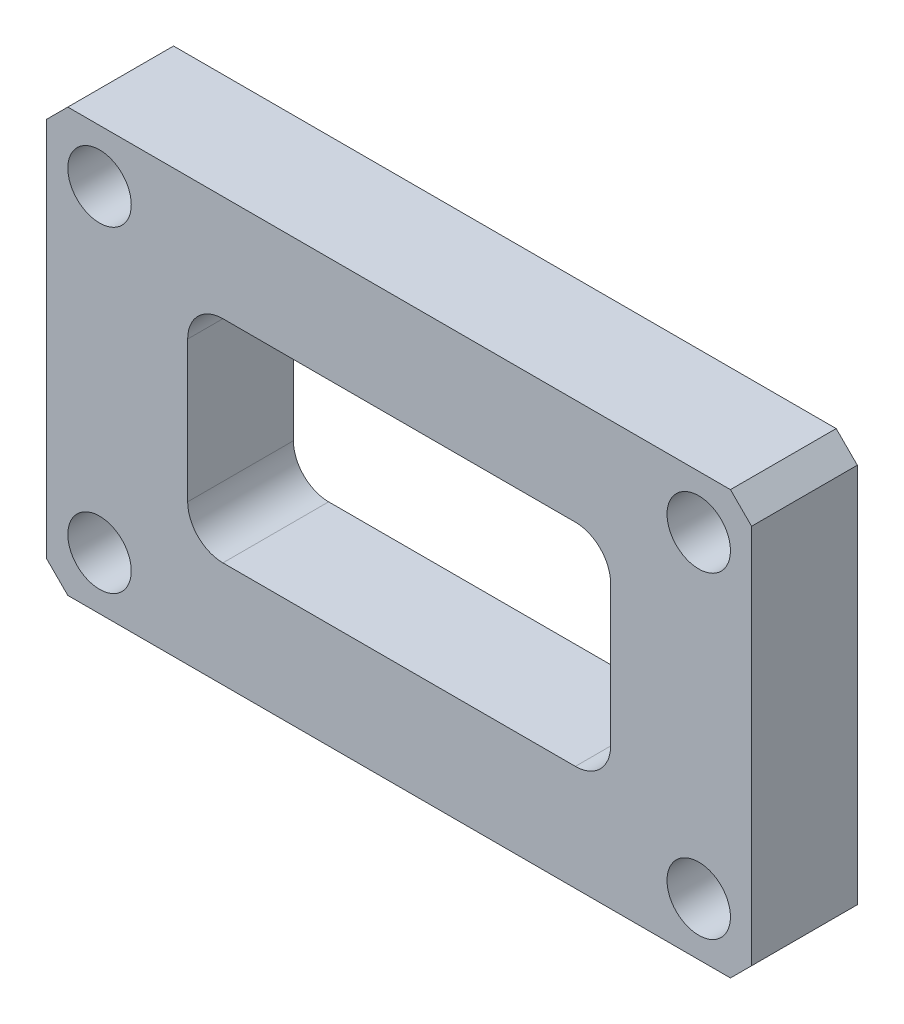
ISO-10303-21;
HEADER;
FILE_DESCRIPTION(('STEP AP214'),'2;1');
FILE_NAME('part.step','',(''),(''),'','','');
FILE_SCHEMA(('AUTOMOTIVE_DESIGN { 1 0 10303 214 1 1 1 1 }'));
ENDSEC;
DATA;
#1=APPLICATION_CONTEXT('core data for automotive mechanical design processes');
#2=APPLICATION_PROTOCOL_DEFINITION('international standard','automotive_design',2000,#1);
#3=PRODUCT_CONTEXT('',#1,'mechanical');
#4=PRODUCT('Part','Part','',(#3));
#5=PRODUCT_RELATED_PRODUCT_CATEGORY('part','',(#4));
#6=PRODUCT_DEFINITION_FORMATION('','',#4);
#7=PRODUCT_DEFINITION_CONTEXT('part definition',#1,'design');
#8=PRODUCT_DEFINITION('design','',#6,#7);
#9=PRODUCT_DEFINITION_SHAPE('','',#8);
#10=(LENGTH_UNIT() NAMED_UNIT(*) SI_UNIT(.MILLI.,.METRE.));
#11=(NAMED_UNIT(*) PLANE_ANGLE_UNIT() SI_UNIT($,.RADIAN.));
#12=(NAMED_UNIT(*) SI_UNIT($,.STERADIAN.) SOLID_ANGLE_UNIT());
#13=UNCERTAINTY_MEASURE_WITH_UNIT(LENGTH_MEASURE(1.E-05),#10,'distance_accuracy_value','');
#14=(GEOMETRIC_REPRESENTATION_CONTEXT(3) GLOBAL_UNCERTAINTY_ASSIGNED_CONTEXT((#13)) GLOBAL_UNIT_ASSIGNED_CONTEXT((#10,
#11,#12)) REPRESENTATION_CONTEXT('',''));
#15=CARTESIAN_POINT('',(0.,0.,0.));
#16=DIRECTION('',(0.,0.,1.));
#17=DIRECTION('',(1.,0.,0.));
#18=AXIS2_PLACEMENT_3D('',#15,#16,#17);
#19=CARTESIAN_POINT('',(0.,0.,15.));
#20=DIRECTION('',(0.,0.,-1.));
#21=DIRECTION('',(-1.,0.,0.));
#22=AXIS2_PLACEMENT_3D('',#19,#20,#21);
#23=PLANE('',#22);
#24=CARTESIAN_POINT('',(-42.5,-22.5,15.));
#25=DIRECTION('',(0.,0.,1.));
#26=DIRECTION('',(1.,0.,0.));
#27=AXIS2_PLACEMENT_3D('',#24,#25,#26);
#28=CIRCLE('',#27,4.5);
#29=CARTESIAN_POINT('',(-38.,-22.5,15.));
#30=VERTEX_POINT('',#29);
#31=EDGE_CURVE('E377',#30,#30,#28,.T.);
#32=ORIENTED_EDGE('',*,*,#31,.F.);
#33=EDGE_LOOP('',(#32));
#34=FACE_BOUND('',#33,.T.);
#35=CARTESIAN_POINT('',(42.5,-22.5,15.));
#36=DIRECTION('',(0.,0.,1.));
#37=DIRECTION('',(1.,0.,0.));
#38=AXIS2_PLACEMENT_3D('',#35,#36,#37);
#39=CIRCLE('',#38,4.5);
#40=CARTESIAN_POINT('',(47.,-22.5,15.));
#41=VERTEX_POINT('',#40);
#42=EDGE_CURVE('E359',#41,#41,#39,.T.);
#43=ORIENTED_EDGE('',*,*,#42,.F.);
#44=EDGE_LOOP('',(#43));
#45=FACE_BOUND('',#44,.T.);
#46=DIRECTION('',(-1.,0.,0.));
#47=VECTOR('',#46,1.);
#48=CARTESIAN_POINT('',(-30.,15.,15.));
#49=LINE('',#48,#47);
#50=CARTESIAN_POINT('',(25.,15.,15.));
#51=VERTEX_POINT('',#50);
#52=CARTESIAN_POINT('',(-25.,15.,15.));
#53=VERTEX_POINT('',#52);
#54=EDGE_CURVE('E173',#51,#53,#49,.T.);
#55=ORIENTED_EDGE('',*,*,#54,.F.);
#56=CARTESIAN_POINT('',(25.,10.,15.));
#57=DIRECTION('',(0.,0.,-1.));
#58=DIRECTION('',(-1.,0.,0.));
#59=AXIS2_PLACEMENT_3D('',#56,#57,#58);
#60=CIRCLE('',#59,5.);
#61=CARTESIAN_POINT('',(30.,10.,15.));
#62=VERTEX_POINT('',#61);
#63=EDGE_CURVE('E172',#51,#62,#60,.T.);
#64=ORIENTED_EDGE('',*,*,#63,.T.);
#65=DIRECTION('',(0.,1.,0.));
#66=VECTOR('',#65,1.);
#67=CARTESIAN_POINT('',(30.,-15.,15.));
#68=LINE('',#67,#66);
#69=CARTESIAN_POINT('',(30.,-10.,15.));
#70=VERTEX_POINT('',#69);
#71=EDGE_CURVE('E164',#70,#62,#68,.T.);
#72=ORIENTED_EDGE('',*,*,#71,.F.);
#73=CARTESIAN_POINT('',(25.,-10.,15.));
#74=DIRECTION('',(0.,0.,-1.));
#75=DIRECTION('',(-1.,0.,0.));
#76=AXIS2_PLACEMENT_3D('',#73,#74,#75);
#77=CIRCLE('',#76,5.);
#78=CARTESIAN_POINT('',(25.,-15.,15.));
#79=VERTEX_POINT('',#78);
#80=EDGE_CURVE('E147',#70,#79,#77,.T.);
#81=ORIENTED_EDGE('',*,*,#80,.T.);
#82=DIRECTION('',(1.,0.,0.));
#83=VECTOR('',#82,1.);
#84=CARTESIAN_POINT('',(-30.,-15.,15.));
#85=LINE('',#84,#83);
#86=CARTESIAN_POINT('',(-25.,-15.,15.));
#87=VERTEX_POINT('',#86);
#88=EDGE_CURVE('E184',#87,#79,#85,.T.);
#89=ORIENTED_EDGE('',*,*,#88,.F.);
#90=CARTESIAN_POINT('',(-25.,-10.,15.));
#91=DIRECTION('',(0.,0.,-1.));
#92=DIRECTION('',(-1.,0.,0.));
#93=AXIS2_PLACEMENT_3D('',#90,#91,#92);
#94=CIRCLE('',#93,5.);
#95=CARTESIAN_POINT('',(-30.,-10.,15.));
#96=VERTEX_POINT('',#95);
#97=EDGE_CURVE('E231',#87,#96,#94,.T.);
#98=ORIENTED_EDGE('',*,*,#97,.T.);
#99=DIRECTION('',(0.,-1.,0.));
#100=VECTOR('',#99,1.);
#101=CARTESIAN_POINT('',(-30.,-15.,15.));
#102=LINE('',#101,#100);
#103=CARTESIAN_POINT('',(-30.,10.,15.));
#104=VERTEX_POINT('',#103);
#105=EDGE_CURVE('E176',#104,#96,#102,.T.);
#106=ORIENTED_EDGE('',*,*,#105,.F.);
#107=CARTESIAN_POINT('',(-25.,10.,15.));
#108=DIRECTION('',(0.,0.,-1.));
#109=DIRECTION('',(-1.,0.,0.));
#110=AXIS2_PLACEMENT_3D('',#107,#108,#109);
#111=CIRCLE('',#110,5.);
#112=EDGE_CURVE('E227',#104,#53,#111,.T.);
#113=ORIENTED_EDGE('',*,*,#112,.T.);
#114=EDGE_LOOP('',(#55,#64,#72,#81,#89,#98,#106,#113));
#115=FACE_BOUND('',#114,.T.);
#116=DIRECTION('',(0.,-1.,0.));
#117=VECTOR('',#116,1.);
#118=CARTESIAN_POINT('',(-50.,-30.,15.));
#119=LINE('',#118,#117);
#120=CARTESIAN_POINT('',(-50.,27.,15.));
#121=VERTEX_POINT('',#120);
#122=CARTESIAN_POINT('',(-50.,-27.,15.));
#123=VERTEX_POINT('',#122);
#124=EDGE_CURVE('E195',#121,#123,#119,.T.);
#125=ORIENTED_EDGE('',*,*,#124,.T.);
#126=DIRECTION('',(-0.707106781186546,0.707106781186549,0.));
#127=VECTOR('',#126,1.);
#128=CARTESIAN_POINT('',(-47.,-30.,15.));
#129=LINE('',#128,#127);
#130=CARTESIAN_POINT('',(-47.,-30.,15.));
#131=VERTEX_POINT('',#130);
#132=EDGE_CURVE('E258',#123,#131,#129,.F.);
#133=ORIENTED_EDGE('',*,*,#132,.T.);
#134=DIRECTION('',(1.,0.,0.));
#135=VECTOR('',#134,1.);
#136=CARTESIAN_POINT('',(-50.,-30.,15.));
#137=LINE('',#136,#135);
#138=CARTESIAN_POINT('',(47.,-30.,15.));
#139=VERTEX_POINT('',#138);
#140=EDGE_CURVE('E198',#131,#139,#137,.T.);
#141=ORIENTED_EDGE('',*,*,#140,.T.);
#142=DIRECTION('',(-0.707106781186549,-0.707106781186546,0.));
#143=VECTOR('',#142,1.);
#144=CARTESIAN_POINT('',(50.,-27.,15.));
#145=LINE('',#144,#143);
#146=CARTESIAN_POINT('',(50.,-27.,15.));
#147=VERTEX_POINT('',#146);
#148=EDGE_CURVE('E256',#139,#147,#145,.F.);
#149=ORIENTED_EDGE('',*,*,#148,.T.);
#150=DIRECTION('',(0.,1.,0.));
#151=VECTOR('',#150,1.);
#152=CARTESIAN_POINT('',(50.,-30.,15.));
#153=LINE('',#152,#151);
#154=CARTESIAN_POINT('',(50.,27.,15.));
#155=VERTEX_POINT('',#154);
#156=EDGE_CURVE('E190',#147,#155,#153,.T.);
#157=ORIENTED_EDGE('',*,*,#156,.T.);
#158=DIRECTION('',(0.707106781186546,-0.707106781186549,0.));
#159=VECTOR('',#158,1.);
#160=CARTESIAN_POINT('',(47.,30.,15.));
#161=LINE('',#160,#159);
#162=CARTESIAN_POINT('',(47.,30.,15.));
#163=VERTEX_POINT('',#162);
#164=EDGE_CURVE('E54',#155,#163,#161,.F.);
#165=ORIENTED_EDGE('',*,*,#164,.T.);
#166=DIRECTION('',(-1.,0.,0.));
#167=VECTOR('',#166,1.);
#168=CARTESIAN_POINT('',(-50.,30.,15.));
#169=LINE('',#168,#167);
#170=CARTESIAN_POINT('',(-47.,30.,15.));
#171=VERTEX_POINT('',#170);
#172=EDGE_CURVE('E192',#163,#171,#169,.T.);
#173=ORIENTED_EDGE('',*,*,#172,.T.);
#174=DIRECTION('',(0.707106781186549,0.707106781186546,0.));
#175=VECTOR('',#174,1.);
#176=CARTESIAN_POINT('',(-50.,27.,15.));
#177=LINE('',#176,#175);
#178=EDGE_CURVE('E253',#171,#121,#177,.F.);
#179=ORIENTED_EDGE('',*,*,#178,.T.);
#180=EDGE_LOOP('',(#125,#133,#141,#149,#157,#165,#173,#179));
#181=FACE_BOUND('',#180,.T.);
#182=CARTESIAN_POINT('',(-42.5,22.5,15.));
#183=DIRECTION('',(0.,0.,1.));
#184=DIRECTION('',(1.,0.,0.));
#185=AXIS2_PLACEMENT_3D('',#182,#183,#184);
#186=CIRCLE('',#185,4.5);
#187=CARTESIAN_POINT('',(-38.,22.5,15.));
#188=VERTEX_POINT('',#187);
#189=EDGE_CURVE('E365',#188,#188,#186,.T.);
#190=ORIENTED_EDGE('',*,*,#189,.F.);
#191=EDGE_LOOP('',(#190));
#192=FACE_BOUND('',#191,.T.);
#193=CARTESIAN_POINT('',(42.5,22.5,15.));
#194=DIRECTION('',(0.,0.,1.));
#195=DIRECTION('',(1.,0.,0.));
#196=AXIS2_PLACEMENT_3D('',#193,#194,#195);
#197=CIRCLE('',#196,4.5);
#198=CARTESIAN_POINT('',(47.,22.5,15.));
#199=VERTEX_POINT('',#198);
#200=EDGE_CURVE('E371',#199,#199,#197,.T.);
#201=ORIENTED_EDGE('',*,*,#200,.F.);
#202=EDGE_LOOP('',(#201));
#203=FACE_BOUND('',#202,.T.);
#204=ADVANCED_FACE('F33',(#34,#45,#115,#181,#192,#203),#23,.F.);
#205=CARTESIAN_POINT('',(50.,-30.,15.));
#206=DIRECTION('',(-1.,0.,0.));
#207=DIRECTION('',(0.,0.,1.));
#208=AXIS2_PLACEMENT_3D('',#205,#206,#207);
#209=PLANE('',#208);
#210=ORIENTED_EDGE('',*,*,#156,.F.);
#211=DIRECTION('',(0.,0.,-1.));
#212=VECTOR('',#211,1.);
#213=CARTESIAN_POINT('',(50.,-27.,15.));
#214=LINE('',#213,#212);
#215=CARTESIAN_POINT('',(50.,-27.,0.));
#216=VERTEX_POINT('',#215);
#217=EDGE_CURVE('E262',#147,#216,#214,.T.);
#218=ORIENTED_EDGE('',*,*,#217,.T.);
#219=DIRECTION('',(0.,1.,0.));
#220=VECTOR('',#219,1.);
#221=CARTESIAN_POINT('',(50.,-30.,0.));
#222=LINE('',#221,#220);
#223=CARTESIAN_POINT('',(50.,27.,0.));
#224=VERTEX_POINT('',#223);
#225=EDGE_CURVE('E189',#216,#224,#222,.T.);
#226=ORIENTED_EDGE('',*,*,#225,.T.);
#227=DIRECTION('',(0.,0.,1.));
#228=VECTOR('',#227,1.);
#229=CARTESIAN_POINT('',(50.,27.,15.));
#230=LINE('',#229,#228);
#231=EDGE_CURVE('E260',#224,#155,#230,.T.);
#232=ORIENTED_EDGE('',*,*,#231,.T.);
#233=EDGE_LOOP('',(#210,#218,#226,#232));
#234=FACE_BOUND('',#233,.T.);
#235=ADVANCED_FACE('F268',(#234),#209,.F.);
#236=CARTESIAN_POINT('',(-50.,30.,15.));
#237=DIRECTION('',(0.,-1.,0.));
#238=DIRECTION('',(0.,0.,-1.));
#239=AXIS2_PLACEMENT_3D('',#236,#237,#238);
#240=PLANE('',#239);
#241=ORIENTED_EDGE('',*,*,#172,.F.);
#242=DIRECTION('',(0.,0.,-1.));
#243=VECTOR('',#242,1.);
#244=CARTESIAN_POINT('',(47.,30.,15.));
#245=LINE('',#244,#243);
#246=CARTESIAN_POINT('',(47.,30.,0.));
#247=VERTEX_POINT('',#246);
#248=EDGE_CURVE('E11',#163,#247,#245,.T.);
#249=ORIENTED_EDGE('',*,*,#248,.T.);
#250=DIRECTION('',(-1.,0.,0.));
#251=VECTOR('',#250,1.);
#252=CARTESIAN_POINT('',(-50.,30.,0.));
#253=LINE('',#252,#251);
#254=CARTESIAN_POINT('',(-47.,30.,0.));
#255=VERTEX_POINT('',#254);
#256=EDGE_CURVE('E203',#247,#255,#253,.T.);
#257=ORIENTED_EDGE('',*,*,#256,.T.);
#258=DIRECTION('',(0.,0.,1.));
#259=VECTOR('',#258,1.);
#260=CARTESIAN_POINT('',(-47.,30.,15.));
#261=LINE('',#260,#259);
#262=EDGE_CURVE('E41',#255,#171,#261,.T.);
#263=ORIENTED_EDGE('',*,*,#262,.T.);
#264=EDGE_LOOP('',(#241,#249,#257,#263));
#265=FACE_BOUND('',#264,.T.);
#266=ADVANCED_FACE('F279',(#265),#240,.F.);
#267=CARTESIAN_POINT('',(-50.,-30.,15.));
#268=DIRECTION('',(1.,0.,0.));
#269=DIRECTION('',(0.,0.,-1.));
#270=AXIS2_PLACEMENT_3D('',#267,#268,#269);
#271=PLANE('',#270);
#272=DIRECTION('',(0.,-1.,0.));
#273=VECTOR('',#272,1.);
#274=CARTESIAN_POINT('',(-50.,-30.,0.));
#275=LINE('',#274,#273);
#276=CARTESIAN_POINT('',(-50.,27.,0.));
#277=VERTEX_POINT('',#276);
#278=CARTESIAN_POINT('',(-50.,-27.,0.));
#279=VERTEX_POINT('',#278);
#280=EDGE_CURVE('E205',#277,#279,#275,.T.);
#281=ORIENTED_EDGE('',*,*,#280,.T.);
#282=DIRECTION('',(0.,0.,1.));
#283=VECTOR('',#282,1.);
#284=CARTESIAN_POINT('',(-50.,-27.,15.));
#285=LINE('',#284,#283);
#286=EDGE_CURVE('E251',#279,#123,#285,.T.);
#287=ORIENTED_EDGE('',*,*,#286,.T.);
#288=ORIENTED_EDGE('',*,*,#124,.F.);
#289=DIRECTION('',(0.,0.,-1.));
#290=VECTOR('',#289,1.);
#291=CARTESIAN_POINT('',(-50.,27.,15.));
#292=LINE('',#291,#290);
#293=EDGE_CURVE('E248',#121,#277,#292,.T.);
#294=ORIENTED_EDGE('',*,*,#293,.T.);
#295=EDGE_LOOP('',(#281,#287,#288,#294));
#296=FACE_BOUND('',#295,.T.);
#297=ADVANCED_FACE('F287',(#296),#271,.F.);
#298=CARTESIAN_POINT('',(-50.,-30.,15.));
#299=DIRECTION('',(0.,1.,0.));
#300=DIRECTION('',(0.,0.,1.));
#301=AXIS2_PLACEMENT_3D('',#298,#299,#300);
#302=PLANE('',#301);
#303=ORIENTED_EDGE('',*,*,#140,.F.);
#304=DIRECTION('',(0.,0.,-1.));
#305=VECTOR('',#304,1.);
#306=CARTESIAN_POINT('',(-47.,-30.,15.));
#307=LINE('',#306,#305);
#308=CARTESIAN_POINT('',(-47.,-30.,0.));
#309=VERTEX_POINT('',#308);
#310=EDGE_CURVE('E237',#131,#309,#307,.T.);
#311=ORIENTED_EDGE('',*,*,#310,.T.);
#312=DIRECTION('',(1.,0.,0.));
#313=VECTOR('',#312,1.);
#314=CARTESIAN_POINT('',(-50.,-30.,0.));
#315=LINE('',#314,#313);
#316=CARTESIAN_POINT('',(47.,-30.,0.));
#317=VERTEX_POINT('',#316);
#318=EDGE_CURVE('E193',#309,#317,#315,.T.);
#319=ORIENTED_EDGE('',*,*,#318,.T.);
#320=DIRECTION('',(0.,0.,1.));
#321=VECTOR('',#320,1.);
#322=CARTESIAN_POINT('',(47.,-30.,15.));
#323=LINE('',#322,#321);
#324=EDGE_CURVE('E235',#317,#139,#323,.T.);
#325=ORIENTED_EDGE('',*,*,#324,.T.);
#326=EDGE_LOOP('',(#303,#311,#319,#325));
#327=FACE_BOUND('',#326,.T.);
#328=ADVANCED_FACE('F295',(#327),#302,.F.);
#329=CARTESIAN_POINT('',(0.,0.,0.));
#330=DIRECTION('',(0.,0.,-1.));
#331=DIRECTION('',(-1.,0.,0.));
#332=AXIS2_PLACEMENT_3D('',#329,#330,#331);
#333=PLANE('',#332);
#334=CARTESIAN_POINT('',(-42.5,-22.5,0.));
#335=DIRECTION('',(0.,0.,-1.));
#336=DIRECTION('',(-1.,0.,0.));
#337=AXIS2_PLACEMENT_3D('',#334,#335,#336);
#338=CIRCLE('',#337,4.5);
#339=CARTESIAN_POINT('',(-47.,-22.5,0.));
#340=VERTEX_POINT('',#339);
#341=EDGE_CURVE('E374',#340,#340,#338,.T.);
#342=ORIENTED_EDGE('',*,*,#341,.F.);
#343=EDGE_LOOP('',(#342));
#344=FACE_BOUND('',#343,.T.);
#345=CARTESIAN_POINT('',(42.5,22.5,0.));
#346=DIRECTION('',(0.,0.,-1.));
#347=DIRECTION('',(-1.,0.,0.));
#348=AXIS2_PLACEMENT_3D('',#345,#346,#347);
#349=CIRCLE('',#348,4.5);
#350=CARTESIAN_POINT('',(38.,22.5,0.));
#351=VERTEX_POINT('',#350);
#352=EDGE_CURVE('E368',#351,#351,#349,.T.);
#353=ORIENTED_EDGE('',*,*,#352,.F.);
#354=EDGE_LOOP('',(#353));
#355=FACE_BOUND('',#354,.T.);
#356=CARTESIAN_POINT('',(-42.5,22.5,0.));
#357=DIRECTION('',(0.,0.,-1.));
#358=DIRECTION('',(-1.,0.,0.));
#359=AXIS2_PLACEMENT_3D('',#356,#357,#358);
#360=CIRCLE('',#359,4.5);
#361=CARTESIAN_POINT('',(-47.,22.5,0.));
#362=VERTEX_POINT('',#361);
#363=EDGE_CURVE('E362',#362,#362,#360,.T.);
#364=ORIENTED_EDGE('',*,*,#363,.F.);
#365=EDGE_LOOP('',(#364));
#366=FACE_BOUND('',#365,.T.);
#367=CARTESIAN_POINT('',(42.5,-22.5,0.));
#368=DIRECTION('',(0.,0.,-1.));
#369=DIRECTION('',(-1.,0.,0.));
#370=AXIS2_PLACEMENT_3D('',#367,#368,#369);
#371=CIRCLE('',#370,4.5);
#372=CARTESIAN_POINT('',(38.,-22.5,0.));
#373=VERTEX_POINT('',#372);
#374=EDGE_CURVE('E354',#373,#373,#371,.T.);
#375=ORIENTED_EDGE('',*,*,#374,.F.);
#376=EDGE_LOOP('',(#375));
#377=FACE_BOUND('',#376,.T.);
#378=DIRECTION('',(1.,0.,0.));
#379=VECTOR('',#378,1.);
#380=CARTESIAN_POINT('',(-30.,-15.,0.));
#381=LINE('',#380,#379);
#382=CARTESIAN_POINT('',(-25.,-15.,0.));
#383=VERTEX_POINT('',#382);
#384=CARTESIAN_POINT('',(25.,-15.,0.));
#385=VERTEX_POINT('',#384);
#386=EDGE_CURVE('E178',#383,#385,#381,.T.);
#387=ORIENTED_EDGE('',*,*,#386,.T.);
#388=CARTESIAN_POINT('',(25.,-10.,0.));
#389=DIRECTION('',(0.,0.,-1.));
#390=DIRECTION('',(-1.,0.,0.));
#391=AXIS2_PLACEMENT_3D('',#388,#389,#390);
#392=CIRCLE('',#391,5.);
#393=CARTESIAN_POINT('',(30.,-10.,0.));
#394=VERTEX_POINT('',#393);
#395=EDGE_CURVE('E157',#385,#394,#392,.F.);
#396=ORIENTED_EDGE('',*,*,#395,.T.);
#397=DIRECTION('',(0.,1.,0.));
#398=VECTOR('',#397,1.);
#399=CARTESIAN_POINT('',(30.,-15.,0.));
#400=LINE('',#399,#398);
#401=CARTESIAN_POINT('',(30.,10.,0.));
#402=VERTEX_POINT('',#401);
#403=EDGE_CURVE('E167',#394,#402,#400,.T.);
#404=ORIENTED_EDGE('',*,*,#403,.T.);
#405=CARTESIAN_POINT('',(25.,10.,0.));
#406=DIRECTION('',(0.,0.,-1.));
#407=DIRECTION('',(-1.,0.,0.));
#408=AXIS2_PLACEMENT_3D('',#405,#406,#407);
#409=CIRCLE('',#408,5.);
#410=CARTESIAN_POINT('',(25.,15.,0.));
#411=VERTEX_POINT('',#410);
#412=EDGE_CURVE('E225',#402,#411,#409,.F.);
#413=ORIENTED_EDGE('',*,*,#412,.T.);
#414=DIRECTION('',(-1.,0.,0.));
#415=VECTOR('',#414,1.);
#416=CARTESIAN_POINT('',(-30.,15.,0.));
#417=LINE('',#416,#415);
#418=CARTESIAN_POINT('',(-25.,15.,0.));
#419=VERTEX_POINT('',#418);
#420=EDGE_CURVE('E186',#411,#419,#417,.T.);
#421=ORIENTED_EDGE('',*,*,#420,.T.);
#422=CARTESIAN_POINT('',(-25.,10.,0.));
#423=DIRECTION('',(0.,0.,-1.));
#424=DIRECTION('',(-1.,0.,0.));
#425=AXIS2_PLACEMENT_3D('',#422,#423,#424);
#426=CIRCLE('',#425,5.);
#427=CARTESIAN_POINT('',(-30.,10.,0.));
#428=VERTEX_POINT('',#427);
#429=EDGE_CURVE('E229',#419,#428,#426,.F.);
#430=ORIENTED_EDGE('',*,*,#429,.T.);
#431=DIRECTION('',(0.,-1.,0.));
#432=VECTOR('',#431,1.);
#433=CARTESIAN_POINT('',(-30.,-15.,0.));
#434=LINE('',#433,#432);
#435=CARTESIAN_POINT('',(-30.,-10.,0.));
#436=VERTEX_POINT('',#435);
#437=EDGE_CURVE('E351',#428,#436,#434,.T.);
#438=ORIENTED_EDGE('',*,*,#437,.T.);
#439=CARTESIAN_POINT('',(-25.,-10.,0.));
#440=DIRECTION('',(0.,0.,-1.));
#441=DIRECTION('',(-1.,0.,0.));
#442=AXIS2_PLACEMENT_3D('',#439,#440,#441);
#443=CIRCLE('',#442,5.);
#444=EDGE_CURVE('E233',#436,#383,#443,.F.);
#445=ORIENTED_EDGE('',*,*,#444,.T.);
#446=EDGE_LOOP('',(#387,#396,#404,#413,#421,#430,#438,#445));
#447=FACE_BOUND('',#446,.T.);
#448=ORIENTED_EDGE('',*,*,#318,.F.);
#449=DIRECTION('',(0.707106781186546,-0.707106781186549,0.));
#450=VECTOR('',#449,1.);
#451=CARTESIAN_POINT('',(-38.5000000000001,-38.4999999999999,0.));
#452=LINE('',#451,#450);
#453=EDGE_CURVE('E246',#309,#279,#452,.F.);
#454=ORIENTED_EDGE('',*,*,#453,.T.);
#455=ORIENTED_EDGE('',*,*,#280,.F.);
#456=DIRECTION('',(-0.707106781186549,-0.707106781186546,0.));
#457=VECTOR('',#456,1.);
#458=CARTESIAN_POINT('',(-38.4999999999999,38.5000000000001,0.));
#459=LINE('',#458,#457);
#460=EDGE_CURVE('E240',#277,#255,#459,.F.);
#461=ORIENTED_EDGE('',*,*,#460,.T.);
#462=ORIENTED_EDGE('',*,*,#256,.F.);
#463=DIRECTION('',(-0.707106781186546,0.707106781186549,0.));
#464=VECTOR('',#463,1.);
#465=CARTESIAN_POINT('',(38.5000000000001,38.4999999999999,0.));
#466=LINE('',#465,#464);
#467=EDGE_CURVE('E242',#247,#224,#466,.F.);
#468=ORIENTED_EDGE('',*,*,#467,.T.);
#469=ORIENTED_EDGE('',*,*,#225,.F.);
#470=DIRECTION('',(0.707106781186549,0.707106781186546,0.));
#471=VECTOR('',#470,1.);
#472=CARTESIAN_POINT('',(38.4999999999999,-38.5000000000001,0.));
#473=LINE('',#472,#471);
#474=EDGE_CURVE('E244',#216,#317,#473,.F.);
#475=ORIENTED_EDGE('',*,*,#474,.T.);
#476=EDGE_LOOP('',(#448,#454,#455,#461,#462,#468,#469,#475));
#477=FACE_BOUND('',#476,.T.);
#478=ADVANCED_FACE('F274',(#344,#355,#366,#377,#447,#477),#333,.T.);
#479=CARTESIAN_POINT('',(30.,-15.,-0.000999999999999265));
#480=DIRECTION('',(1.,0.,0.));
#481=DIRECTION('',(0.,0.,-1.));
#482=AXIS2_PLACEMENT_3D('',#479,#480,#481);
#483=PLANE('',#482);
#484=ORIENTED_EDGE('',*,*,#403,.F.);
#485=DIRECTION('',(0.,0.,1.));
#486=VECTOR('',#485,1.);
#487=CARTESIAN_POINT('',(30.,-10.,15.));
#488=LINE('',#487,#486);
#489=EDGE_CURVE('E151',#394,#70,#488,.T.);
#490=ORIENTED_EDGE('',*,*,#489,.T.);
#491=ORIENTED_EDGE('',*,*,#71,.T.);
#492=DIRECTION('',(0.,0.,1.));
#493=VECTOR('',#492,1.);
#494=CARTESIAN_POINT('',(30.,10.,0.));
#495=LINE('',#494,#493);
#496=EDGE_CURVE('E169',#62,#402,#495,.F.);
#497=ORIENTED_EDGE('',*,*,#496,.T.);
#498=EDGE_LOOP('',(#484,#490,#491,#497));
#499=FACE_BOUND('',#498,.T.);
#500=ADVANCED_FACE('F163',(#499),#483,.F.);
#501=CARTESIAN_POINT('',(-30.,-15.,-0.000999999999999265));
#502=DIRECTION('',(0.,-1.,0.));
#503=DIRECTION('',(0.,0.,-1.));
#504=AXIS2_PLACEMENT_3D('',#501,#502,#503);
#505=PLANE('',#504);
#506=ORIENTED_EDGE('',*,*,#88,.T.);
#507=DIRECTION('',(0.,0.,1.));
#508=VECTOR('',#507,1.);
#509=CARTESIAN_POINT('',(25.,-15.,0.));
#510=LINE('',#509,#508);
#511=EDGE_CURVE('E152',#79,#385,#510,.F.);
#512=ORIENTED_EDGE('',*,*,#511,.T.);
#513=ORIENTED_EDGE('',*,*,#386,.F.);
#514=DIRECTION('',(0.,0.,1.));
#515=VECTOR('',#514,1.);
#516=CARTESIAN_POINT('',(-25.,-15.,15.));
#517=LINE('',#516,#515);
#518=EDGE_CURVE('E168',#383,#87,#517,.T.);
#519=ORIENTED_EDGE('',*,*,#518,.T.);
#520=EDGE_LOOP('',(#506,#512,#513,#519));
#521=FACE_BOUND('',#520,.T.);
#522=ADVANCED_FACE('F353',(#521),#505,.F.);
#523=CARTESIAN_POINT('',(-30.,-15.,-0.000999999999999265));
#524=DIRECTION('',(-1.,0.,0.));
#525=DIRECTION('',(0.,0.,1.));
#526=AXIS2_PLACEMENT_3D('',#523,#524,#525);
#527=PLANE('',#526);
#528=ORIENTED_EDGE('',*,*,#437,.F.);
#529=DIRECTION('',(0.,0.,1.));
#530=VECTOR('',#529,1.);
#531=CARTESIAN_POINT('',(-30.,10.,15.));
#532=LINE('',#531,#530);
#533=EDGE_CURVE('E158',#428,#104,#532,.T.);
#534=ORIENTED_EDGE('',*,*,#533,.T.);
#535=ORIENTED_EDGE('',*,*,#105,.T.);
#536=DIRECTION('',(0.,0.,1.));
#537=VECTOR('',#536,1.);
#538=CARTESIAN_POINT('',(-30.,-10.,0.));
#539=LINE('',#538,#537);
#540=EDGE_CURVE('E219',#96,#436,#539,.F.);
#541=ORIENTED_EDGE('',*,*,#540,.T.);
#542=EDGE_LOOP('',(#528,#534,#535,#541));
#543=FACE_BOUND('',#542,.T.);
#544=ADVANCED_FACE('F408',(#543),#527,.F.);
#545=CARTESIAN_POINT('',(-30.,15.,-0.000999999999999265));
#546=DIRECTION('',(0.,1.,0.));
#547=DIRECTION('',(0.,0.,1.));
#548=AXIS2_PLACEMENT_3D('',#545,#546,#547);
#549=PLANE('',#548);
#550=ORIENTED_EDGE('',*,*,#420,.F.);
#551=DIRECTION('',(0.,0.,1.));
#552=VECTOR('',#551,1.);
#553=CARTESIAN_POINT('',(25.,15.,15.));
#554=LINE('',#553,#552);
#555=EDGE_CURVE('E216',#411,#51,#554,.T.);
#556=ORIENTED_EDGE('',*,*,#555,.T.);
#557=ORIENTED_EDGE('',*,*,#54,.T.);
#558=DIRECTION('',(0.,0.,1.));
#559=VECTOR('',#558,1.);
#560=CARTESIAN_POINT('',(-25.,15.,0.));
#561=LINE('',#560,#559);
#562=EDGE_CURVE('E214',#53,#419,#561,.F.);
#563=ORIENTED_EDGE('',*,*,#562,.T.);
#564=EDGE_LOOP('',(#550,#556,#557,#563));
#565=FACE_BOUND('',#564,.T.);
#566=ADVANCED_FACE('F331',(#565),#549,.F.);
#567=CARTESIAN_POINT('',(25.,-10.,-0.000999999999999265));
#568=DIRECTION('',(0.,0.,-1.));
#569=DIRECTION('',(-1.,0.,0.));
#570=AXIS2_PLACEMENT_3D('',#567,#568,#569);
#571=CYLINDRICAL_SURFACE('',#570,5.);
#572=ORIENTED_EDGE('',*,*,#395,.F.);
#573=ORIENTED_EDGE('',*,*,#511,.F.);
#574=ORIENTED_EDGE('',*,*,#80,.F.);
#575=ORIENTED_EDGE('',*,*,#489,.F.);
#576=EDGE_LOOP('',(#572,#573,#574,#575));
#577=FACE_BOUND('',#576,.T.);
#578=ADVANCED_FACE('F150',(#577),#571,.F.);
#579=CARTESIAN_POINT('',(25.,10.,-0.000999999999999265));
#580=DIRECTION('',(0.,0.,-1.));
#581=DIRECTION('',(-1.,0.,0.));
#582=AXIS2_PLACEMENT_3D('',#579,#580,#581);
#583=CYLINDRICAL_SURFACE('',#582,5.);
#584=ORIENTED_EDGE('',*,*,#412,.F.);
#585=ORIENTED_EDGE('',*,*,#496,.F.);
#586=ORIENTED_EDGE('',*,*,#63,.F.);
#587=ORIENTED_EDGE('',*,*,#555,.F.);
#588=EDGE_LOOP('',(#584,#585,#586,#587));
#589=FACE_BOUND('',#588,.T.);
#590=ADVANCED_FACE('F330',(#589),#583,.F.);
#591=CARTESIAN_POINT('',(-25.,10.,-0.000999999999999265));
#592=DIRECTION('',(0.,0.,-1.));
#593=DIRECTION('',(-1.,0.,0.));
#594=AXIS2_PLACEMENT_3D('',#591,#592,#593);
#595=CYLINDRICAL_SURFACE('',#594,5.);
#596=ORIENTED_EDGE('',*,*,#429,.F.);
#597=ORIENTED_EDGE('',*,*,#562,.F.);
#598=ORIENTED_EDGE('',*,*,#112,.F.);
#599=ORIENTED_EDGE('',*,*,#533,.F.);
#600=EDGE_LOOP('',(#596,#597,#598,#599));
#601=FACE_BOUND('',#600,.T.);
#602=ADVANCED_FACE('F334',(#601),#595,.F.);
#603=CARTESIAN_POINT('',(-25.,-10.,-0.000999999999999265));
#604=DIRECTION('',(0.,0.,-1.));
#605=DIRECTION('',(-1.,0.,0.));
#606=AXIS2_PLACEMENT_3D('',#603,#604,#605);
#607=CYLINDRICAL_SURFACE('',#606,5.);
#608=ORIENTED_EDGE('',*,*,#444,.F.);
#609=ORIENTED_EDGE('',*,*,#540,.F.);
#610=ORIENTED_EDGE('',*,*,#97,.F.);
#611=ORIENTED_EDGE('',*,*,#518,.F.);
#612=EDGE_LOOP('',(#608,#609,#610,#611));
#613=FACE_BOUND('',#612,.T.);
#614=ADVANCED_FACE('F304',(#613),#607,.F.);
#615=CARTESIAN_POINT('',(-47.,-30.,15.));
#616=DIRECTION('',(0.707106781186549,0.707106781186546,0.));
#617=DIRECTION('',(0.,0.,-1.));
#618=AXIS2_PLACEMENT_3D('',#615,#616,#617);
#619=PLANE('',#618);
#620=ORIENTED_EDGE('',*,*,#132,.F.);
#621=ORIENTED_EDGE('',*,*,#286,.F.);
#622=ORIENTED_EDGE('',*,*,#453,.F.);
#623=ORIENTED_EDGE('',*,*,#310,.F.);
#624=EDGE_LOOP('',(#620,#621,#622,#623));
#625=FACE_BOUND('',#624,.T.);
#626=ADVANCED_FACE('F292',(#625),#619,.F.);
#627=CARTESIAN_POINT('',(50.,-27.,15.));
#628=DIRECTION('',(-0.707106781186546,0.707106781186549,0.));
#629=DIRECTION('',(0.,0.,-1.));
#630=AXIS2_PLACEMENT_3D('',#627,#628,#629);
#631=PLANE('',#630);
#632=ORIENTED_EDGE('',*,*,#148,.F.);
#633=ORIENTED_EDGE('',*,*,#324,.F.);
#634=ORIENTED_EDGE('',*,*,#474,.F.);
#635=ORIENTED_EDGE('',*,*,#217,.F.);
#636=EDGE_LOOP('',(#632,#633,#634,#635));
#637=FACE_BOUND('',#636,.T.);
#638=ADVANCED_FACE('F297',(#637),#631,.F.);
#639=CARTESIAN_POINT('',(47.,30.,15.));
#640=DIRECTION('',(-0.707106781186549,-0.707106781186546,0.));
#641=DIRECTION('',(0.,0.,-1.));
#642=AXIS2_PLACEMENT_3D('',#639,#640,#641);
#643=PLANE('',#642);
#644=ORIENTED_EDGE('',*,*,#164,.F.);
#645=ORIENTED_EDGE('',*,*,#231,.F.);
#646=ORIENTED_EDGE('',*,*,#467,.F.);
#647=ORIENTED_EDGE('',*,*,#248,.F.);
#648=EDGE_LOOP('',(#644,#645,#646,#647));
#649=FACE_BOUND('',#648,.T.);
#650=ADVANCED_FACE('F278',(#649),#643,.F.);
#651=CARTESIAN_POINT('',(-50.,27.,15.));
#652=DIRECTION('',(0.707106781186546,-0.707106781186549,0.));
#653=DIRECTION('',(0.,0.,-1.));
#654=AXIS2_PLACEMENT_3D('',#651,#652,#653);
#655=PLANE('',#654);
#656=ORIENTED_EDGE('',*,*,#178,.F.);
#657=ORIENTED_EDGE('',*,*,#262,.F.);
#658=ORIENTED_EDGE('',*,*,#460,.F.);
#659=ORIENTED_EDGE('',*,*,#293,.F.);
#660=EDGE_LOOP('',(#656,#657,#658,#659));
#661=FACE_BOUND('',#660,.T.);
#662=ADVANCED_FACE('F35',(#661),#655,.F.);
#663=CARTESIAN_POINT('',(42.5,-22.5,15.));
#664=DIRECTION('',(0.,0.,1.));
#665=DIRECTION('',(1.,0.,0.));
#666=AXIS2_PLACEMENT_3D('',#663,#664,#665);
#667=CYLINDRICAL_SURFACE('',#666,4.5);
#668=ORIENTED_EDGE('',*,*,#42,.T.);
#669=EDGE_LOOP('',(#668));
#670=FACE_BOUND('',#669,.T.);
#671=ORIENTED_EDGE('',*,*,#374,.T.);
#672=EDGE_LOOP('',(#671));
#673=FACE_BOUND('',#672,.T.);
#674=ADVANCED_FACE('F393',(#670,#673),#667,.F.);
#675=CARTESIAN_POINT('',(-42.5,22.5,15.));
#676=DIRECTION('',(0.,0.,1.));
#677=DIRECTION('',(1.,0.,0.));
#678=AXIS2_PLACEMENT_3D('',#675,#676,#677);
#679=CYLINDRICAL_SURFACE('',#678,4.5);
#680=ORIENTED_EDGE('',*,*,#189,.T.);
#681=EDGE_LOOP('',(#680));
#682=FACE_BOUND('',#681,.T.);
#683=ORIENTED_EDGE('',*,*,#363,.T.);
#684=EDGE_LOOP('',(#683));
#685=FACE_BOUND('',#684,.T.);
#686=ADVANCED_FACE('F395',(#682,#685),#679,.F.);
#687=CARTESIAN_POINT('',(42.5,22.5,15.));
#688=DIRECTION('',(0.,0.,1.));
#689=DIRECTION('',(1.,0.,0.));
#690=AXIS2_PLACEMENT_3D('',#687,#688,#689);
#691=CYLINDRICAL_SURFACE('',#690,4.5);
#692=ORIENTED_EDGE('',*,*,#200,.T.);
#693=EDGE_LOOP('',(#692));
#694=FACE_BOUND('',#693,.T.);
#695=ORIENTED_EDGE('',*,*,#352,.T.);
#696=EDGE_LOOP('',(#695));
#697=FACE_BOUND('',#696,.T.);
#698=ADVANCED_FACE('F383',(#694,#697),#691,.F.);
#699=CARTESIAN_POINT('',(-42.5,-22.5,15.));
#700=DIRECTION('',(0.,0.,1.));
#701=DIRECTION('',(1.,0.,0.));
#702=AXIS2_PLACEMENT_3D('',#699,#700,#701);
#703=CYLINDRICAL_SURFACE('',#702,4.5);
#704=ORIENTED_EDGE('',*,*,#31,.T.);
#705=EDGE_LOOP('',(#704));
#706=FACE_BOUND('',#705,.T.);
#707=ORIENTED_EDGE('',*,*,#341,.T.);
#708=EDGE_LOOP('',(#707));
#709=FACE_BOUND('',#708,.T.);
#710=ADVANCED_FACE('F380',(#706,#709),#703,.F.);
#711=CLOSED_SHELL('',(#204,#235,#266,#297,#328,#478,#500,#522,#544,#566,#578,#590,#602,#614,
#626,#638,#650,#662,#674,#686,#698,#710));
#712=MANIFOLD_SOLID_BREP('B2',#711);
#713=ADVANCED_BREP_SHAPE_REPRESENTATION('',(#18,#712),#14);
#714=SHAPE_DEFINITION_REPRESENTATION(#9,#713);
ENDSEC;
END-ISO-10303-21;
